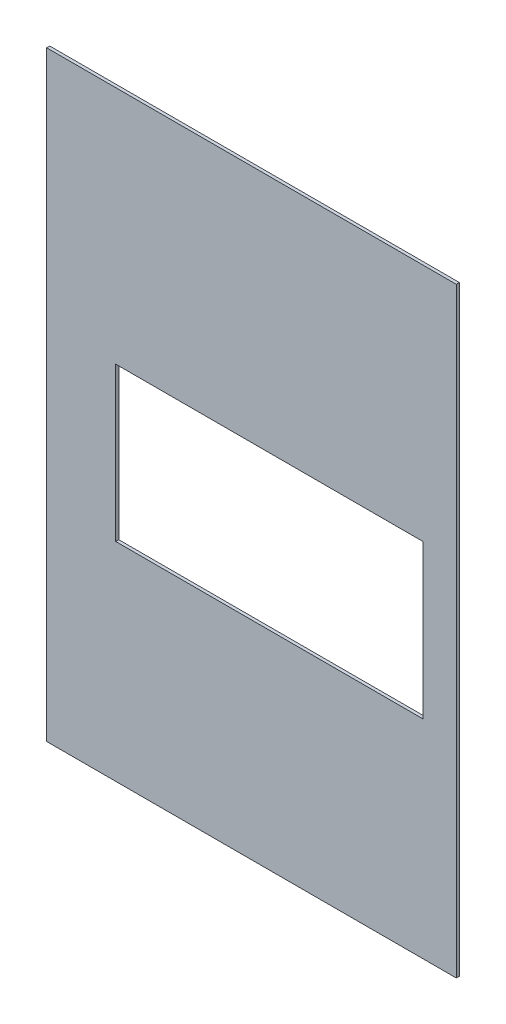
from build123d import *

# Parameters (mm, degrees)
SKETCH1_W           = 1333.5
SKETCH1_H           = 1955.8
SKETCH1_W_2         = 1000
SKETCH1_H_2         = 500
BOSS_EXTRUDE1_DEPTH = 10


with BuildPart() as part:
    # Sketch1 → Boss-Extrude1 (new body)
    with BuildSketch(Plane.XY):
        with Locations((666.75, 977.9)):
            Rectangle(SKETCH1_W, SKETCH1_H)
        with Locations((724.793314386, 926.318527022)):
            Rectangle(SKETCH1_W_2, SKETCH1_H_2, mode=Mode.SUBTRACT)
    extrude(amount=BOSS_EXTRUDE1_DEPTH)


solid = part.part
